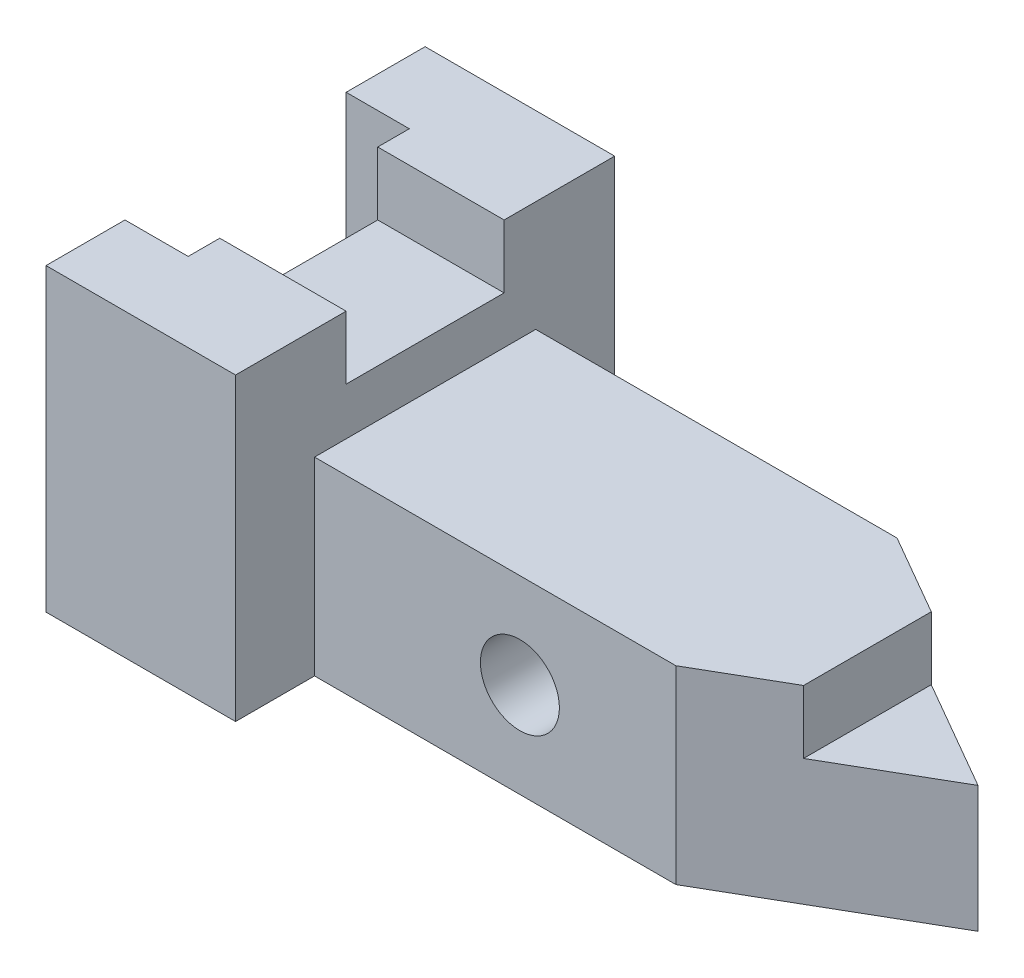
ISO-10303-21;
HEADER;
FILE_DESCRIPTION(('STEP AP214'),'2;1');
FILE_NAME('part.step','',(''),(''),'','','');
FILE_SCHEMA(('AUTOMOTIVE_DESIGN { 1 0 10303 214 1 1 1 1 }'));
ENDSEC;
DATA;
#1=APPLICATION_CONTEXT('core data for automotive mechanical design processes');
#2=APPLICATION_PROTOCOL_DEFINITION('international standard','automotive_design',2000,#1);
#3=PRODUCT_CONTEXT('',#1,'mechanical');
#4=PRODUCT('Part','Part','',(#3));
#5=PRODUCT_RELATED_PRODUCT_CATEGORY('part','',(#4));
#6=PRODUCT_DEFINITION_FORMATION('','',#4);
#7=PRODUCT_DEFINITION_CONTEXT('part definition',#1,'design');
#8=PRODUCT_DEFINITION('design','',#6,#7);
#9=PRODUCT_DEFINITION_SHAPE('','',#8);
#10=(LENGTH_UNIT() NAMED_UNIT(*) SI_UNIT(.MILLI.,.METRE.));
#11=(NAMED_UNIT(*) PLANE_ANGLE_UNIT() SI_UNIT($,.RADIAN.));
#12=(NAMED_UNIT(*) SI_UNIT($,.STERADIAN.) SOLID_ANGLE_UNIT());
#13=UNCERTAINTY_MEASURE_WITH_UNIT(LENGTH_MEASURE(1.E-05),#10,'distance_accuracy_value','');
#14=(GEOMETRIC_REPRESENTATION_CONTEXT(3) GLOBAL_UNCERTAINTY_ASSIGNED_CONTEXT((#13)) GLOBAL_UNIT_ASSIGNED_CONTEXT((#10,
#11,#12)) REPRESENTATION_CONTEXT('',''));
#15=CARTESIAN_POINT('',(0.,0.,0.));
#16=DIRECTION('',(0.,0.,1.));
#17=DIRECTION('',(1.,0.,0.));
#18=AXIS2_PLACEMENT_3D('',#15,#16,#17);
#19=CARTESIAN_POINT('',(0.,-38.,48.));
#20=DIRECTION('',(0.,1.,0.));
#21=DIRECTION('',(0.,0.,1.));
#22=AXIS2_PLACEMENT_3D('',#19,#20,#21);
#23=PLANE('',#22);
#24=DIRECTION('',(1.,0.,0.));
#25=VECTOR('',#24,1.);
#26=CARTESIAN_POINT('',(0.,-38.,10.));
#27=LINE('',#26,#25);
#28=CARTESIAN_POINT('',(24.,-38.,10.));
#29=VERTEX_POINT('',#28);
#30=CARTESIAN_POINT('',(69.7512886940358,-38.,10.));
#31=VERTEX_POINT('',#30);
#32=EDGE_CURVE('E186',#29,#31,#27,.T.);
#33=ORIENTED_EDGE('',*,*,#32,.T.);
#34=DIRECTION('',(0.866025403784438,0.,0.500000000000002));
#35=VECTOR('',#34,1.);
#36=CARTESIAN_POINT('',(94.,-38.,24.));
#37=LINE('',#36,#35);
#38=CARTESIAN_POINT('',(94.,-38.,24.));
#39=VERTEX_POINT('',#38);
#40=EDGE_CURVE('E60',#31,#39,#37,.T.);
#41=ORIENTED_EDGE('',*,*,#40,.T.);
#42=DIRECTION('',(0.866025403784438,0.,-0.500000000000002));
#43=VECTOR('',#42,1.);
#44=CARTESIAN_POINT('',(69.7512886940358,-38.,38.));
#45=LINE('',#44,#43);
#46=CARTESIAN_POINT('',(69.7512886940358,-38.,38.));
#47=VERTEX_POINT('',#46);
#48=EDGE_CURVE('E67',#39,#47,#45,.F.);
#49=ORIENTED_EDGE('',*,*,#48,.T.);
#50=DIRECTION('',(1.,0.,0.));
#51=VECTOR('',#50,1.);
#52=CARTESIAN_POINT('',(0.,-38.,38.));
#53=LINE('',#52,#51);
#54=CARTESIAN_POINT('',(24.,-38.,38.));
#55=VERTEX_POINT('',#54);
#56=EDGE_CURVE('E371',#55,#47,#53,.T.);
#57=ORIENTED_EDGE('',*,*,#56,.F.);
#58=DIRECTION('',(0.,0.,1.));
#59=VECTOR('',#58,1.);
#60=CARTESIAN_POINT('',(24.,-38.,48.));
#61=LINE('',#60,#59);
#62=CARTESIAN_POINT('',(24.,-38.,48.));
#63=VERTEX_POINT('',#62);
#64=EDGE_CURVE('E374',#55,#63,#61,.T.);
#65=ORIENTED_EDGE('',*,*,#64,.T.);
#66=DIRECTION('',(1.,0.,0.));
#67=VECTOR('',#66,1.);
#68=CARTESIAN_POINT('',(0.,-38.,48.));
#69=LINE('',#68,#67);
#70=CARTESIAN_POINT('',(0.,-38.,48.));
#71=VERTEX_POINT('',#70);
#72=EDGE_CURVE('E211',#71,#63,#69,.T.);
#73=ORIENTED_EDGE('',*,*,#72,.F.);
#74=DIRECTION('',(0.,0.,-1.));
#75=VECTOR('',#74,1.);
#76=CARTESIAN_POINT('',(0.,-38.,48.));
#77=LINE('',#76,#75);
#78=CARTESIAN_POINT('',(0.,-38.,38.));
#79=VERTEX_POINT('',#78);
#80=EDGE_CURVE('E215',#71,#79,#77,.T.);
#81=ORIENTED_EDGE('',*,*,#80,.T.);
#82=DIRECTION('',(1.,0.,0.));
#83=VECTOR('',#82,1.);
#84=CARTESIAN_POINT('',(0.,-38.,38.));
#85=LINE('',#84,#83);
#86=CARTESIAN_POINT('',(8.,-38.,38.));
#87=VERTEX_POINT('',#86);
#88=EDGE_CURVE('E244',#79,#87,#85,.T.);
#89=ORIENTED_EDGE('',*,*,#88,.T.);
#90=DIRECTION('',(0.,0.,-1.));
#91=VECTOR('',#90,1.);
#92=CARTESIAN_POINT('',(8.,-38.,48.));
#93=LINE('',#92,#91);
#94=CARTESIAN_POINT('',(8.,-38.,10.));
#95=VERTEX_POINT('',#94);
#96=EDGE_CURVE('E240',#87,#95,#93,.T.);
#97=ORIENTED_EDGE('',*,*,#96,.T.);
#98=DIRECTION('',(-1.,0.,0.));
#99=VECTOR('',#98,1.);
#100=CARTESIAN_POINT('',(0.,-38.,10.));
#101=LINE('',#100,#99);
#102=CARTESIAN_POINT('',(0.,-38.,10.));
#103=VERTEX_POINT('',#102);
#104=EDGE_CURVE('E236',#95,#103,#101,.T.);
#105=ORIENTED_EDGE('',*,*,#104,.T.);
#106=CARTESIAN_POINT('',(0.,-38.,0.));
#107=VERTEX_POINT('',#106);
#108=EDGE_CURVE('E210',#103,#107,#77,.T.);
#109=ORIENTED_EDGE('',*,*,#108,.T.);
#110=DIRECTION('',(1.,0.,0.));
#111=VECTOR('',#110,1.);
#112=CARTESIAN_POINT('',(0.,-38.,0.));
#113=LINE('',#112,#111);
#114=CARTESIAN_POINT('',(24.,-38.,0.));
#115=VERTEX_POINT('',#114);
#116=EDGE_CURVE('E221',#107,#115,#113,.T.);
#117=ORIENTED_EDGE('',*,*,#116,.T.);
#118=DIRECTION('',(0.,0.,1.));
#119=VECTOR('',#118,1.);
#120=CARTESIAN_POINT('',(24.,-38.,48.));
#121=LINE('',#120,#119);
#122=EDGE_CURVE('E192',#115,#29,#121,.T.);
#123=ORIENTED_EDGE('',*,*,#122,.T.);
#124=EDGE_LOOP('',(#33,#41,#49,#57,#65,#73,#81,#89,#97,#105,#109,#117,#123));
#125=FACE_BOUND('',#124,.T.);
#126=ADVANCED_FACE('F49',(#125),#23,.F.);
#127=CARTESIAN_POINT('',(0.,-14.,48.));
#128=DIRECTION('',(0.,1.,0.));
#129=DIRECTION('',(0.,0.,1.));
#130=AXIS2_PLACEMENT_3D('',#127,#128,#129);
#131=PLANE('',#130);
#132=DIRECTION('',(0.,0.,1.));
#133=VECTOR('',#132,1.);
#134=CARTESIAN_POINT('',(80.,-14.,0.));
#135=LINE('',#134,#133);
#136=CARTESIAN_POINT('',(80.,-14.,15.9170962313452));
#137=VERTEX_POINT('',#136);
#138=CARTESIAN_POINT('',(80.,-14.,32.0829037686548));
#139=VERTEX_POINT('',#138);
#140=EDGE_CURVE('E394',#137,#139,#135,.T.);
#141=ORIENTED_EDGE('',*,*,#140,.F.);
#142=DIRECTION('',(-0.866025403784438,0.,-0.500000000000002));
#143=VECTOR('',#142,1.);
#144=CARTESIAN_POINT('',(33.8923048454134,-14.,-10.7031939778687));
#145=LINE('',#144,#143);
#146=CARTESIAN_POINT('',(69.7512886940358,-14.,10.));
#147=VERTEX_POINT('',#146);
#148=EDGE_CURVE('E201',#137,#147,#145,.T.);
#149=ORIENTED_EDGE('',*,*,#148,.T.);
#150=DIRECTION('',(1.,0.,0.));
#151=VECTOR('',#150,1.);
#152=CARTESIAN_POINT('',(0.,-14.,10.));
#153=LINE('',#152,#151);
#154=CARTESIAN_POINT('',(24.,-14.,10.));
#155=VERTEX_POINT('',#154);
#156=EDGE_CURVE('E184',#155,#147,#153,.T.);
#157=ORIENTED_EDGE('',*,*,#156,.F.);
#158=DIRECTION('',(0.,0.,-1.));
#159=VECTOR('',#158,1.);
#160=CARTESIAN_POINT('',(24.,-14.,48.));
#161=LINE('',#160,#159);
#162=CARTESIAN_POINT('',(24.,-14.,38.));
#163=VERTEX_POINT('',#162);
#164=EDGE_CURVE('E199',#163,#155,#161,.T.);
#165=ORIENTED_EDGE('',*,*,#164,.F.);
#166=DIRECTION('',(1.,0.,0.));
#167=VECTOR('',#166,1.);
#168=CARTESIAN_POINT('',(0.,-14.,38.));
#169=LINE('',#168,#167);
#170=CARTESIAN_POINT('',(69.7512886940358,-14.,38.));
#171=VERTEX_POINT('',#170);
#172=EDGE_CURVE('E382',#163,#171,#169,.T.);
#173=ORIENTED_EDGE('',*,*,#172,.T.);
#174=DIRECTION('',(-0.866025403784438,0.,0.500000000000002));
#175=VECTOR('',#174,1.);
#176=CARTESIAN_POINT('',(13.1076951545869,-14.,70.7031939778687));
#177=LINE('',#176,#175);
#178=EDGE_CURVE('E260',#171,#139,#177,.F.);
#179=ORIENTED_EDGE('',*,*,#178,.T.);
#180=EDGE_LOOP('',(#141,#149,#157,#165,#173,#179));
#181=FACE_BOUND('',#180,.T.);
#182=ADVANCED_FACE('F197',(#181),#131,.T.);
#183=CARTESIAN_POINT('',(0.,0.,48.));
#184=DIRECTION('',(0.,1.,0.));
#185=DIRECTION('',(0.,0.,1.));
#186=AXIS2_PLACEMENT_3D('',#183,#184,#185);
#187=PLANE('',#186);
#188=DIRECTION('',(-1.,0.,0.));
#189=VECTOR('',#188,1.);
#190=CARTESIAN_POINT('',(8.,0.,14.));
#191=LINE('',#190,#189);
#192=CARTESIAN_POINT('',(24.,0.,14.));
#193=VERTEX_POINT('',#192);
#194=CARTESIAN_POINT('',(8.,0.,14.));
#195=VERTEX_POINT('',#194);
#196=EDGE_CURVE('E350',#193,#195,#191,.T.);
#197=ORIENTED_EDGE('',*,*,#196,.F.);
#198=DIRECTION('',(0.,0.,-1.));
#199=VECTOR('',#198,1.);
#200=CARTESIAN_POINT('',(24.,0.,48.));
#201=LINE('',#200,#199);
#202=CARTESIAN_POINT('',(24.,0.,0.));
#203=VERTEX_POINT('',#202);
#204=EDGE_CURVE('E231',#193,#203,#201,.T.);
#205=ORIENTED_EDGE('',*,*,#204,.T.);
#206=DIRECTION('',(1.,0.,0.));
#207=VECTOR('',#206,1.);
#208=CARTESIAN_POINT('',(0.,0.,0.));
#209=LINE('',#208,#207);
#210=CARTESIAN_POINT('',(0.,0.,0.));
#211=VERTEX_POINT('',#210);
#212=EDGE_CURVE('E289',#211,#203,#209,.T.);
#213=ORIENTED_EDGE('',*,*,#212,.F.);
#214=DIRECTION('',(0.,0.,-1.));
#215=VECTOR('',#214,1.);
#216=CARTESIAN_POINT('',(0.,0.,48.));
#217=LINE('',#216,#215);
#218=CARTESIAN_POINT('',(0.,0.,10.));
#219=VERTEX_POINT('',#218);
#220=EDGE_CURVE('E226',#219,#211,#217,.T.);
#221=ORIENTED_EDGE('',*,*,#220,.F.);
#222=DIRECTION('',(-1.,0.,0.));
#223=VECTOR('',#222,1.);
#224=CARTESIAN_POINT('',(0.,0.,10.));
#225=LINE('',#224,#223);
#226=CARTESIAN_POINT('',(8.,0.,10.));
#227=VERTEX_POINT('',#226);
#228=EDGE_CURVE('E327',#227,#219,#225,.T.);
#229=ORIENTED_EDGE('',*,*,#228,.F.);
#230=DIRECTION('',(0.,0.,-1.));
#231=VECTOR('',#230,1.);
#232=CARTESIAN_POINT('',(8.,0.,10.));
#233=LINE('',#232,#231);
#234=EDGE_CURVE('E334',#195,#227,#233,.T.);
#235=ORIENTED_EDGE('',*,*,#234,.F.);
#236=EDGE_LOOP('',(#197,#205,#213,#221,#229,#235));
#237=FACE_BOUND('',#236,.T.);
#238=ADVANCED_FACE('F293',(#237),#187,.T.);
#239=CARTESIAN_POINT('',(0.,0.,48.));
#240=DIRECTION('',(1.,0.,0.));
#241=DIRECTION('',(0.,1.,0.));
#242=AXIS2_PLACEMENT_3D('',#239,#240,#241);
#243=PLANE('',#242);
#244=CARTESIAN_POINT('',(0.,0.,48.));
#245=VERTEX_POINT('',#244);
#246=CARTESIAN_POINT('',(0.,0.,38.));
#247=VERTEX_POINT('',#246);
#248=EDGE_CURVE('E227',#245,#247,#217,.T.);
#249=ORIENTED_EDGE('',*,*,#248,.T.);
#250=DIRECTION('',(0.,1.,0.));
#251=VECTOR('',#250,1.);
#252=CARTESIAN_POINT('',(0.,-55.,38.));
#253=LINE('',#252,#251);
#254=EDGE_CURVE('E319',#79,#247,#253,.T.);
#255=ORIENTED_EDGE('',*,*,#254,.F.);
#256=ORIENTED_EDGE('',*,*,#80,.F.);
#257=DIRECTION('',(0.,-1.,0.));
#258=VECTOR('',#257,1.);
#259=CARTESIAN_POINT('',(0.,0.,48.));
#260=LINE('',#259,#258);
#261=EDGE_CURVE('E218',#245,#71,#260,.T.);
#262=ORIENTED_EDGE('',*,*,#261,.F.);
#263=EDGE_LOOP('',(#249,#255,#256,#262));
#264=FACE_BOUND('',#263,.T.);
#265=ADVANCED_FACE('F429',(#264),#243,.F.);
#266=CARTESIAN_POINT('',(24.,0.,48.));
#267=DIRECTION('',(1.,0.,0.));
#268=DIRECTION('',(0.,1.,0.));
#269=AXIS2_PLACEMENT_3D('',#266,#267,#268);
#270=PLANE('',#269);
#271=DIRECTION('',(0.,1.,0.));
#272=VECTOR('',#271,1.);
#273=CARTESIAN_POINT('',(24.,-8.,14.));
#274=LINE('',#273,#272);
#275=CARTESIAN_POINT('',(24.,-8.,14.));
#276=VERTEX_POINT('',#275);
#277=EDGE_CURVE('E343',#276,#193,#274,.T.);
#278=ORIENTED_EDGE('',*,*,#277,.F.);
#279=DIRECTION('',(0.,0.,-1.));
#280=VECTOR('',#279,1.);
#281=CARTESIAN_POINT('',(24.,-8.,14.));
#282=LINE('',#281,#280);
#283=CARTESIAN_POINT('',(24.,-8.,34.));
#284=VERTEX_POINT('',#283);
#285=EDGE_CURVE('E359',#284,#276,#282,.T.);
#286=ORIENTED_EDGE('',*,*,#285,.F.);
#287=DIRECTION('',(0.,1.,0.));
#288=VECTOR('',#287,1.);
#289=CARTESIAN_POINT('',(24.,-8.,34.));
#290=LINE('',#289,#288);
#291=CARTESIAN_POINT('',(24.,0.,34.));
#292=VERTEX_POINT('',#291);
#293=EDGE_CURVE('E338',#284,#292,#290,.T.);
#294=ORIENTED_EDGE('',*,*,#293,.T.);
#295=CARTESIAN_POINT('',(24.,0.,48.));
#296=VERTEX_POINT('',#295);
#297=EDGE_CURVE('E232',#296,#292,#201,.T.);
#298=ORIENTED_EDGE('',*,*,#297,.F.);
#299=DIRECTION('',(0.,-1.,0.));
#300=VECTOR('',#299,1.);
#301=CARTESIAN_POINT('',(24.,0.,48.));
#302=LINE('',#301,#300);
#303=EDGE_CURVE('E309',#296,#63,#302,.T.);
#304=ORIENTED_EDGE('',*,*,#303,.T.);
#305=ORIENTED_EDGE('',*,*,#64,.F.);
#306=DIRECTION('',(0.,1.,0.));
#307=VECTOR('',#306,1.);
#308=CARTESIAN_POINT('',(24.,-48.,38.));
#309=LINE('',#308,#307);
#310=EDGE_CURVE('E203',#55,#163,#309,.T.);
#311=ORIENTED_EDGE('',*,*,#310,.T.);
#312=ORIENTED_EDGE('',*,*,#164,.T.);
#313=DIRECTION('',(0.,1.,0.));
#314=VECTOR('',#313,1.);
#315=CARTESIAN_POINT('',(24.,-48.,10.));
#316=LINE('',#315,#314);
#317=EDGE_CURVE('E180',#29,#155,#316,.T.);
#318=ORIENTED_EDGE('',*,*,#317,.F.);
#319=ORIENTED_EDGE('',*,*,#122,.F.);
#320=DIRECTION('',(0.,-1.,0.));
#321=VECTOR('',#320,1.);
#322=CARTESIAN_POINT('',(24.,0.,0.));
#323=LINE('',#322,#321);
#324=EDGE_CURVE('E297',#203,#115,#323,.T.);
#325=ORIENTED_EDGE('',*,*,#324,.F.);
#326=ORIENTED_EDGE('',*,*,#204,.F.);
#327=EDGE_LOOP('',(#278,#286,#294,#298,#304,#305,#311,#312,#318,#319,#325,#326));
#328=FACE_BOUND('',#327,.T.);
#329=ADVANCED_FACE('F206',(#328),#270,.T.);
#330=DIRECTION('',(1.,0.,0.));
#331=VECTOR('',#330,1.);
#332=CARTESIAN_POINT('',(8.,0.,34.));
#333=LINE('',#332,#331);
#334=CARTESIAN_POINT('',(8.,0.,34.));
#335=VERTEX_POINT('',#334);
#336=EDGE_CURVE('E354',#335,#292,#333,.T.);
#337=ORIENTED_EDGE('',*,*,#336,.F.);
#338=CARTESIAN_POINT('',(8.,0.,38.));
#339=VERTEX_POINT('',#338);
#340=EDGE_CURVE('E330',#339,#335,#233,.T.);
#341=ORIENTED_EDGE('',*,*,#340,.F.);
#342=DIRECTION('',(1.,0.,0.));
#343=VECTOR('',#342,1.);
#344=CARTESIAN_POINT('',(0.,0.,38.));
#345=LINE('',#344,#343);
#346=EDGE_CURVE('E316',#247,#339,#345,.T.);
#347=ORIENTED_EDGE('',*,*,#346,.F.);
#348=ORIENTED_EDGE('',*,*,#248,.F.);
#349=DIRECTION('',(1.,0.,0.));
#350=VECTOR('',#349,1.);
#351=CARTESIAN_POINT('',(0.,0.,48.));
#352=LINE('',#351,#350);
#353=EDGE_CURVE('E305',#245,#296,#352,.T.);
#354=ORIENTED_EDGE('',*,*,#353,.T.);
#355=ORIENTED_EDGE('',*,*,#297,.T.);
#356=EDGE_LOOP('',(#337,#341,#347,#348,#354,#355));
#357=FACE_BOUND('',#356,.T.);
#358=ADVANCED_FACE('F456',(#357),#187,.T.);
#359=ORIENTED_EDGE('',*,*,#108,.F.);
#360=DIRECTION('',(0.,1.,0.));
#361=VECTOR('',#360,1.);
#362=CARTESIAN_POINT('',(0.,-55.,10.));
#363=LINE('',#362,#361);
#364=EDGE_CURVE('E282',#103,#219,#363,.T.);
#365=ORIENTED_EDGE('',*,*,#364,.T.);
#366=ORIENTED_EDGE('',*,*,#220,.T.);
#367=DIRECTION('',(0.,-1.,0.));
#368=VECTOR('',#367,1.);
#369=CARTESIAN_POINT('',(0.,0.,0.));
#370=LINE('',#369,#368);
#371=EDGE_CURVE('E280',#211,#107,#370,.T.);
#372=ORIENTED_EDGE('',*,*,#371,.T.);
#373=EDGE_LOOP('',(#359,#365,#366,#372));
#374=FACE_BOUND('',#373,.T.);
#375=ADVANCED_FACE('F279',(#374),#243,.F.);
#376=CARTESIAN_POINT('',(0.,0.,48.));
#377=DIRECTION('',(0.,0.,1.));
#378=DIRECTION('',(1.,0.,0.));
#379=AXIS2_PLACEMENT_3D('',#376,#377,#378);
#380=PLANE('',#379);
#381=ORIENTED_EDGE('',*,*,#72,.T.);
#382=ORIENTED_EDGE('',*,*,#303,.F.);
#383=ORIENTED_EDGE('',*,*,#353,.F.);
#384=ORIENTED_EDGE('',*,*,#261,.T.);
#385=EDGE_LOOP('',(#381,#382,#383,#384));
#386=FACE_BOUND('',#385,.T.);
#387=ADVANCED_FACE('F423',(#386),#380,.T.);
#388=CARTESIAN_POINT('',(0.,0.,0.));
#389=DIRECTION('',(0.,0.,1.));
#390=DIRECTION('',(1.,0.,0.));
#391=AXIS2_PLACEMENT_3D('',#388,#389,#390);
#392=PLANE('',#391);
#393=ORIENTED_EDGE('',*,*,#324,.T.);
#394=ORIENTED_EDGE('',*,*,#116,.F.);
#395=ORIENTED_EDGE('',*,*,#371,.F.);
#396=ORIENTED_EDGE('',*,*,#212,.T.);
#397=EDGE_LOOP('',(#393,#394,#395,#396));
#398=FACE_BOUND('',#397,.T.);
#399=ADVANCED_FACE('F288',(#398),#392,.F.);
#400=CARTESIAN_POINT('',(8.,-55.,10.));
#401=DIRECTION('',(1.,0.,0.));
#402=DIRECTION('',(0.,0.,-1.));
#403=AXIS2_PLACEMENT_3D('',#400,#401,#402);
#404=PLANE('',#403);
#405=DIRECTION('',(0.,0.,1.));
#406=VECTOR('',#405,1.);
#407=CARTESIAN_POINT('',(8.,-8.,14.));
#408=LINE('',#407,#406);
#409=CARTESIAN_POINT('',(8.,-8.,14.));
#410=VERTEX_POINT('',#409);
#411=CARTESIAN_POINT('',(8.,-8.,34.));
#412=VERTEX_POINT('',#411);
#413=EDGE_CURVE('E353',#410,#412,#408,.T.);
#414=ORIENTED_EDGE('',*,*,#413,.F.);
#415=DIRECTION('',(0.,1.,0.));
#416=VECTOR('',#415,1.);
#417=CARTESIAN_POINT('',(8.,-8.,14.));
#418=LINE('',#417,#416);
#419=EDGE_CURVE('E346',#410,#195,#418,.T.);
#420=ORIENTED_EDGE('',*,*,#419,.T.);
#421=ORIENTED_EDGE('',*,*,#234,.T.);
#422=DIRECTION('',(0.,1.,0.));
#423=VECTOR('',#422,1.);
#424=CARTESIAN_POINT('',(8.,-55.,10.));
#425=LINE('',#424,#423);
#426=EDGE_CURVE('E312',#95,#227,#425,.T.);
#427=ORIENTED_EDGE('',*,*,#426,.F.);
#428=ORIENTED_EDGE('',*,*,#96,.F.);
#429=DIRECTION('',(0.,1.,0.));
#430=VECTOR('',#429,1.);
#431=CARTESIAN_POINT('',(8.,-55.,38.));
#432=LINE('',#431,#430);
#433=EDGE_CURVE('E300',#87,#339,#432,.T.);
#434=ORIENTED_EDGE('',*,*,#433,.T.);
#435=ORIENTED_EDGE('',*,*,#340,.T.);
#436=DIRECTION('',(0.,1.,0.));
#437=VECTOR('',#436,1.);
#438=CARTESIAN_POINT('',(8.,-8.,34.));
#439=LINE('',#438,#437);
#440=EDGE_CURVE('E335',#412,#335,#439,.T.);
#441=ORIENTED_EDGE('',*,*,#440,.F.);
#442=EDGE_LOOP('',(#414,#420,#421,#427,#428,#434,#435,#441));
#443=FACE_BOUND('',#442,.T.);
#444=ADVANCED_FACE('F437',(#443),#404,.F.);
#445=CARTESIAN_POINT('',(0.,-55.,38.));
#446=DIRECTION('',(0.,0.,1.));
#447=DIRECTION('',(1.,0.,0.));
#448=AXIS2_PLACEMENT_3D('',#445,#446,#447);
#449=PLANE('',#448);
#450=ORIENTED_EDGE('',*,*,#254,.T.);
#451=ORIENTED_EDGE('',*,*,#346,.T.);
#452=ORIENTED_EDGE('',*,*,#433,.F.);
#453=ORIENTED_EDGE('',*,*,#88,.F.);
#454=EDGE_LOOP('',(#450,#451,#452,#453));
#455=FACE_BOUND('',#454,.T.);
#456=ADVANCED_FACE('F432',(#455),#449,.F.);
#457=CARTESIAN_POINT('',(0.,-55.,10.));
#458=DIRECTION('',(0.,0.,-1.));
#459=DIRECTION('',(-1.,0.,0.));
#460=AXIS2_PLACEMENT_3D('',#457,#458,#459);
#461=PLANE('',#460);
#462=ORIENTED_EDGE('',*,*,#426,.T.);
#463=ORIENTED_EDGE('',*,*,#228,.T.);
#464=ORIENTED_EDGE('',*,*,#364,.F.);
#465=ORIENTED_EDGE('',*,*,#104,.F.);
#466=EDGE_LOOP('',(#462,#463,#464,#465));
#467=FACE_BOUND('',#466,.T.);
#468=ADVANCED_FACE('F442',(#467),#461,.F.);
#469=CARTESIAN_POINT('',(8.,-8.,14.));
#470=DIRECTION('',(0.,0.,-1.));
#471=DIRECTION('',(-1.,0.,0.));
#472=AXIS2_PLACEMENT_3D('',#469,#470,#471);
#473=PLANE('',#472);
#474=ORIENTED_EDGE('',*,*,#196,.T.);
#475=ORIENTED_EDGE('',*,*,#419,.F.);
#476=DIRECTION('',(-1.,0.,0.));
#477=VECTOR('',#476,1.);
#478=CARTESIAN_POINT('',(8.,-8.,14.));
#479=LINE('',#478,#477);
#480=EDGE_CURVE('E339',#276,#410,#479,.T.);
#481=ORIENTED_EDGE('',*,*,#480,.F.);
#482=ORIENTED_EDGE('',*,*,#277,.T.);
#483=EDGE_LOOP('',(#474,#475,#481,#482));
#484=FACE_BOUND('',#483,.T.);
#485=ADVANCED_FACE('F449',(#484),#473,.F.);
#486=CARTESIAN_POINT('',(8.,-8.,34.));
#487=DIRECTION('',(0.,0.,1.));
#488=DIRECTION('',(1.,0.,0.));
#489=AXIS2_PLACEMENT_3D('',#486,#487,#488);
#490=PLANE('',#489);
#491=ORIENTED_EDGE('',*,*,#336,.T.);
#492=ORIENTED_EDGE('',*,*,#293,.F.);
#493=DIRECTION('',(1.,0.,0.));
#494=VECTOR('',#493,1.);
#495=CARTESIAN_POINT('',(8.,-8.,34.));
#496=LINE('',#495,#494);
#497=EDGE_CURVE('E362',#412,#284,#496,.T.);
#498=ORIENTED_EDGE('',*,*,#497,.F.);
#499=ORIENTED_EDGE('',*,*,#440,.T.);
#500=EDGE_LOOP('',(#491,#492,#498,#499));
#501=FACE_BOUND('',#500,.T.);
#502=ADVANCED_FACE('F453',(#501),#490,.F.);
#503=CARTESIAN_POINT('',(0.,-8.,0.));
#504=DIRECTION('',(0.,1.,0.));
#505=DIRECTION('',(0.,0.,1.));
#506=AXIS2_PLACEMENT_3D('',#503,#504,#505);
#507=PLANE('',#506);
#508=ORIENTED_EDGE('',*,*,#413,.T.);
#509=ORIENTED_EDGE('',*,*,#497,.T.);
#510=ORIENTED_EDGE('',*,*,#285,.T.);
#511=ORIENTED_EDGE('',*,*,#480,.T.);
#512=EDGE_LOOP('',(#508,#509,#510,#511));
#513=FACE_BOUND('',#512,.T.);
#514=ADVANCED_FACE('F451',(#513),#507,.T.);
#515=CARTESIAN_POINT('',(0.,-48.,10.));
#516=DIRECTION('',(0.,0.,1.));
#517=DIRECTION('',(1.,0.,0.));
#518=AXIS2_PLACEMENT_3D('',#515,#516,#517);
#519=PLANE('',#518);
#520=CARTESIAN_POINT('',(50.,-26.,10.));
#521=DIRECTION('',(0.,0.,1.));
#522=DIRECTION('',(1.,0.,0.));
#523=AXIS2_PLACEMENT_3D('',#520,#521,#522);
#524=CIRCLE('',#523,5.);
#525=CARTESIAN_POINT('',(55.,-26.,10.));
#526=VERTEX_POINT('',#525);
#527=EDGE_CURVE('E384',#526,#526,#524,.T.);
#528=ORIENTED_EDGE('',*,*,#527,.T.);
#529=EDGE_LOOP('',(#528));
#530=FACE_BOUND('',#529,.T.);
#531=ORIENTED_EDGE('',*,*,#156,.T.);
#532=DIRECTION('',(0.,-1.,0.));
#533=VECTOR('',#532,1.);
#534=CARTESIAN_POINT('',(69.7512886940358,-38.,10.));
#535=LINE('',#534,#533);
#536=EDGE_CURVE('E265',#147,#31,#535,.T.);
#537=ORIENTED_EDGE('',*,*,#536,.T.);
#538=ORIENTED_EDGE('',*,*,#32,.F.);
#539=ORIENTED_EDGE('',*,*,#317,.T.);
#540=EDGE_LOOP('',(#531,#537,#538,#539));
#541=FACE_BOUND('',#540,.T.);
#542=ADVANCED_FACE('F182',(#530,#541),#519,.F.);
#543=CARTESIAN_POINT('',(0.,-48.,38.));
#544=DIRECTION('',(0.,0.,1.));
#545=DIRECTION('',(1.,0.,0.));
#546=AXIS2_PLACEMENT_3D('',#543,#544,#545);
#547=PLANE('',#546);
#548=ORIENTED_EDGE('',*,*,#56,.T.);
#549=DIRECTION('',(0.,1.,0.));
#550=VECTOR('',#549,1.);
#551=CARTESIAN_POINT('',(69.7512886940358,-48.,38.));
#552=LINE('',#551,#550);
#553=EDGE_CURVE('E11',#47,#171,#552,.T.);
#554=ORIENTED_EDGE('',*,*,#553,.T.);
#555=ORIENTED_EDGE('',*,*,#172,.F.);
#556=ORIENTED_EDGE('',*,*,#310,.F.);
#557=EDGE_LOOP('',(#548,#554,#555,#556));
#558=FACE_BOUND('',#557,.T.);
#559=CARTESIAN_POINT('',(50.,-26.,38.));
#560=DIRECTION('',(0.,0.,1.));
#561=DIRECTION('',(1.,0.,0.));
#562=AXIS2_PLACEMENT_3D('',#559,#560,#561);
#563=CIRCLE('',#562,5.);
#564=CARTESIAN_POINT('',(55.,-26.,38.));
#565=VERTEX_POINT('',#564);
#566=EDGE_CURVE('E389',#565,#565,#563,.T.);
#567=ORIENTED_EDGE('',*,*,#566,.F.);
#568=EDGE_LOOP('',(#567));
#569=FACE_BOUND('',#568,.T.);
#570=ADVANCED_FACE('F418',(#558,#569),#547,.T.);
#571=CARTESIAN_POINT('',(50.,-26.,3.99999999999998));
#572=DIRECTION('',(0.,0.,1.));
#573=DIRECTION('',(1.,0.,0.));
#574=AXIS2_PLACEMENT_3D('',#571,#572,#573);
#575=CYLINDRICAL_SURFACE('',#574,5.);
#576=ORIENTED_EDGE('',*,*,#566,.T.);
#577=EDGE_LOOP('',(#576));
#578=FACE_BOUND('',#577,.T.);
#579=ORIENTED_EDGE('',*,*,#527,.F.);
#580=EDGE_LOOP('',(#579));
#581=FACE_BOUND('',#580,.T.);
#582=ADVANCED_FACE('F491',(#578,#581),#575,.F.);
#583=CARTESIAN_POINT('',(94.,-22.,0.));
#584=DIRECTION('',(0.,-1.,0.));
#585=DIRECTION('',(0.,0.,-1.));
#586=AXIS2_PLACEMENT_3D('',#583,#584,#585);
#587=PLANE('',#586);
#588=DIRECTION('',(-0.866025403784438,0.,0.500000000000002));
#589=VECTOR('',#588,1.);
#590=CARTESIAN_POINT('',(69.7512886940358,-22.,38.));
#591=LINE('',#590,#589);
#592=CARTESIAN_POINT('',(80.,-22.,32.0829037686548));
#593=VERTEX_POINT('',#592);
#594=CARTESIAN_POINT('',(94.,-22.,24.));
#595=VERTEX_POINT('',#594);
#596=EDGE_CURVE('E248',#593,#595,#591,.F.);
#597=ORIENTED_EDGE('',*,*,#596,.T.);
#598=DIRECTION('',(-0.866025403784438,0.,-0.500000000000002));
#599=VECTOR('',#598,1.);
#600=CARTESIAN_POINT('',(94.,-22.,24.));
#601=LINE('',#600,#599);
#602=CARTESIAN_POINT('',(80.,-22.,15.9170962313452));
#603=VERTEX_POINT('',#602);
#604=EDGE_CURVE('E251',#595,#603,#601,.T.);
#605=ORIENTED_EDGE('',*,*,#604,.T.);
#606=DIRECTION('',(0.,0.,1.));
#607=VECTOR('',#606,1.);
#608=CARTESIAN_POINT('',(80.,-22.,0.));
#609=LINE('',#608,#607);
#610=EDGE_CURVE('E393',#603,#593,#609,.T.);
#611=ORIENTED_EDGE('',*,*,#610,.T.);
#612=EDGE_LOOP('',(#597,#605,#611));
#613=FACE_BOUND('',#612,.T.);
#614=ADVANCED_FACE('F403',(#613),#587,.F.);
#615=CARTESIAN_POINT('',(80.,-14.,0.));
#616=DIRECTION('',(-1.,0.,0.));
#617=DIRECTION('',(0.,0.,1.));
#618=AXIS2_PLACEMENT_3D('',#615,#616,#617);
#619=PLANE('',#618);
#620=ORIENTED_EDGE('',*,*,#610,.F.);
#621=DIRECTION('',(0.,1.,0.));
#622=VECTOR('',#621,1.);
#623=CARTESIAN_POINT('',(80.,0.,15.9170962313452));
#624=LINE('',#623,#622);
#625=EDGE_CURVE('E257',#603,#137,#624,.T.);
#626=ORIENTED_EDGE('',*,*,#625,.T.);
#627=ORIENTED_EDGE('',*,*,#140,.T.);
#628=DIRECTION('',(0.,1.,0.));
#629=VECTOR('',#628,1.);
#630=CARTESIAN_POINT('',(80.,-48.,32.0829037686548));
#631=LINE('',#630,#629);
#632=EDGE_CURVE('E254',#139,#593,#631,.F.);
#633=ORIENTED_EDGE('',*,*,#632,.T.);
#634=EDGE_LOOP('',(#620,#626,#627,#633));
#635=FACE_BOUND('',#634,.T.);
#636=ADVANCED_FACE('F416',(#635),#619,.F.);
#637=CARTESIAN_POINT('',(69.7512886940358,-48.,38.));
#638=DIRECTION('',(-0.500000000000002,0.,-0.866025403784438));
#639=DIRECTION('',(0.,1.,0.));
#640=AXIS2_PLACEMENT_3D('',#637,#638,#639);
#641=PLANE('',#640);
#642=ORIENTED_EDGE('',*,*,#553,.F.);
#643=ORIENTED_EDGE('',*,*,#48,.F.);
#644=DIRECTION('',(0.,-1.,0.));
#645=VECTOR('',#644,1.);
#646=CARTESIAN_POINT('',(94.,0.,24.));
#647=LINE('',#646,#645);
#648=EDGE_CURVE('E54',#595,#39,#647,.T.);
#649=ORIENTED_EDGE('',*,*,#648,.F.);
#650=ORIENTED_EDGE('',*,*,#596,.F.);
#651=ORIENTED_EDGE('',*,*,#632,.F.);
#652=ORIENTED_EDGE('',*,*,#178,.F.);
#653=EDGE_LOOP('',(#642,#643,#649,#650,#651,#652));
#654=FACE_BOUND('',#653,.T.);
#655=ADVANCED_FACE('F52',(#654),#641,.F.);
#656=CARTESIAN_POINT('',(94.,0.,24.));
#657=DIRECTION('',(0.500000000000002,0.,-0.866025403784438));
#658=DIRECTION('',(0.,-1.,0.));
#659=AXIS2_PLACEMENT_3D('',#656,#657,#658);
#660=PLANE('',#659);
#661=ORIENTED_EDGE('',*,*,#40,.F.);
#662=ORIENTED_EDGE('',*,*,#536,.F.);
#663=ORIENTED_EDGE('',*,*,#148,.F.);
#664=ORIENTED_EDGE('',*,*,#625,.F.);
#665=ORIENTED_EDGE('',*,*,#604,.F.);
#666=ORIENTED_EDGE('',*,*,#648,.T.);
#667=EDGE_LOOP('',(#661,#662,#663,#664,#665,#666));
#668=FACE_BOUND('',#667,.T.);
#669=ADVANCED_FACE('F415',(#668),#660,.T.);
#670=CLOSED_SHELL('',(#126,#182,#238,#265,#329,#358,#375,#387,#399,#444,#456,#468,#485,#502,
#514,#542,#570,#582,#614,#636,#655,#669));
#671=MANIFOLD_SOLID_BREP('B2',#670);
#672=ADVANCED_BREP_SHAPE_REPRESENTATION('',(#18,#671),#14);
#673=SHAPE_DEFINITION_REPRESENTATION(#9,#672);
ENDSEC;
END-ISO-10303-21;
